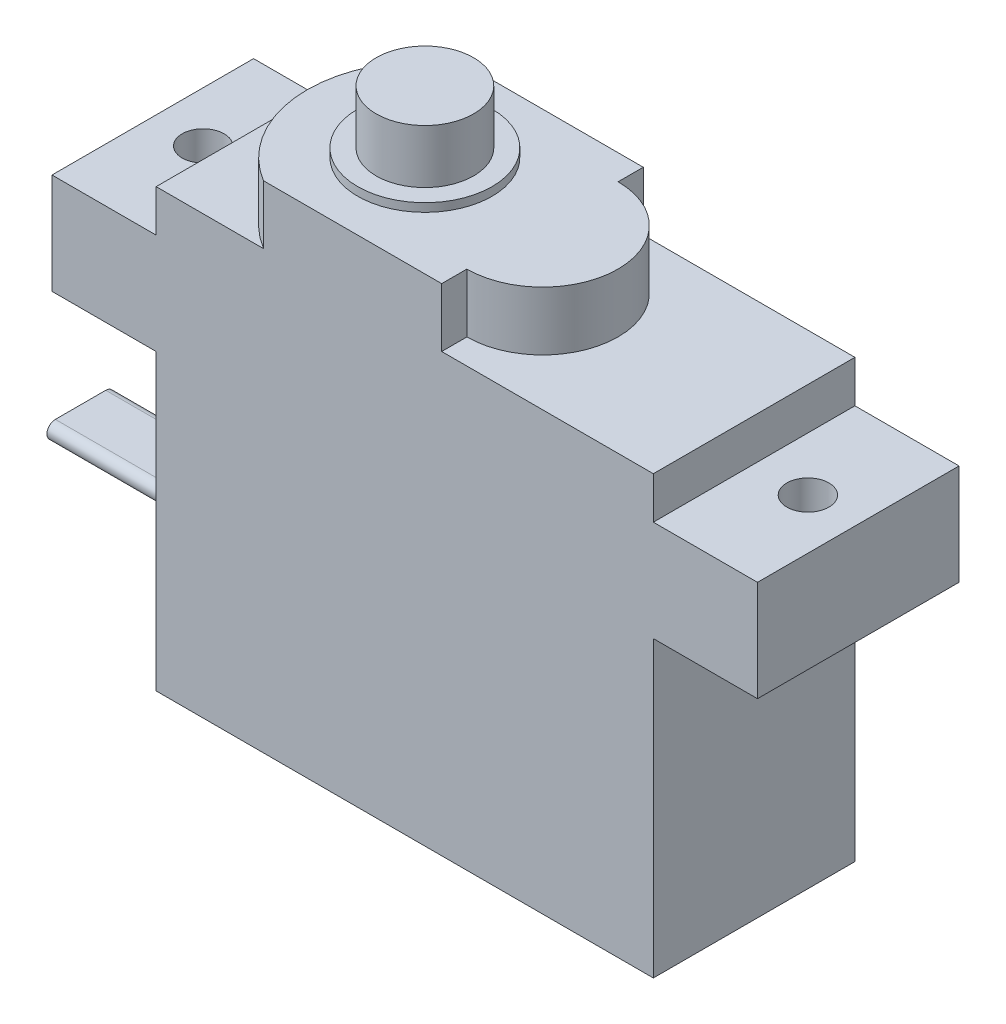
ISO-10303-21;
HEADER;
FILE_DESCRIPTION(('STEP AP214'),'2;1');
FILE_NAME('part.step','',(''),(''),'','','');
FILE_SCHEMA(('AUTOMOTIVE_DESIGN { 1 0 10303 214 1 1 1 1 }'));
ENDSEC;
DATA;
#1=APPLICATION_CONTEXT('core data for automotive mechanical design processes');
#2=APPLICATION_PROTOCOL_DEFINITION('international standard','automotive_design',2000,#1);
#3=PRODUCT_CONTEXT('',#1,'mechanical');
#4=PRODUCT('Part','Part','',(#3));
#5=PRODUCT_RELATED_PRODUCT_CATEGORY('part','',(#4));
#6=PRODUCT_DEFINITION_FORMATION('','',#4);
#7=PRODUCT_DEFINITION_CONTEXT('part definition',#1,'design');
#8=PRODUCT_DEFINITION('design','',#6,#7);
#9=PRODUCT_DEFINITION_SHAPE('','',#8);
#10=(LENGTH_UNIT() NAMED_UNIT(*) SI_UNIT(.MILLI.,.METRE.));
#11=(NAMED_UNIT(*) PLANE_ANGLE_UNIT() SI_UNIT($,.RADIAN.));
#12=(NAMED_UNIT(*) SI_UNIT($,.STERADIAN.) SOLID_ANGLE_UNIT());
#13=UNCERTAINTY_MEASURE_WITH_UNIT(LENGTH_MEASURE(1.E-05),#10,'distance_accuracy_value','');
#14=(GEOMETRIC_REPRESENTATION_CONTEXT(3) GLOBAL_UNCERTAINTY_ASSIGNED_CONTEXT((#13)) GLOBAL_UNIT_ASSIGNED_CONTEXT((#10,
#11,#12)) REPRESENTATION_CONTEXT('',''));
#15=CARTESIAN_POINT('',(0.,0.,0.));
#16=DIRECTION('',(0.,0.,1.));
#17=DIRECTION('',(1.,0.,0.));
#18=AXIS2_PLACEMENT_3D('',#15,#16,#17);
#19=CARTESIAN_POINT('',(-0.5,6.,4.50000000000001));
#20=DIRECTION('',(-1.,0.,0.));
#21=DIRECTION('',(0.,0.,1.));
#22=AXIS2_PLACEMENT_3D('',#19,#20,#21);
#23=PLANE('',#22);
#24=CARTESIAN_POINT('',(-0.5,6.,4.50000000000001));
#25=DIRECTION('',(-1.,0.,0.));
#26=DIRECTION('',(0.,0.,1.));
#27=AXIS2_PLACEMENT_3D('',#24,#25,#26);
#28=CIRCLE('',#27,1.);
#29=CARTESIAN_POINT('',(-0.5,7.,4.50000000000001));
#30=VERTEX_POINT('',#29);
#31=CARTESIAN_POINT('',(-0.5,5.,4.50000000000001));
#32=VERTEX_POINT('',#31);
#33=EDGE_CURVE('E239',#30,#32,#28,.T.);
#34=ORIENTED_EDGE('',*,*,#33,.T.);
#35=DIRECTION('',(0.,0.,1.));
#36=VECTOR('',#35,1.);
#37=CARTESIAN_POINT('',(-0.5,5.,7.50000000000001));
#38=LINE('',#37,#36);
#39=CARTESIAN_POINT('',(-0.5,5.,7.50000000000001));
#40=VERTEX_POINT('',#39);
#41=EDGE_CURVE('E242',#32,#40,#38,.T.);
#42=ORIENTED_EDGE('',*,*,#41,.T.);
#43=CARTESIAN_POINT('',(-0.5,6.,7.5));
#44=DIRECTION('',(-1.,0.,0.));
#45=DIRECTION('',(0.,0.,-1.));
#46=AXIS2_PLACEMENT_3D('',#43,#44,#45);
#47=CIRCLE('',#46,1.);
#48=CARTESIAN_POINT('',(-0.5,7.,7.5));
#49=VERTEX_POINT('',#48);
#50=EDGE_CURVE('E245',#40,#49,#47,.T.);
#51=ORIENTED_EDGE('',*,*,#50,.T.);
#52=DIRECTION('',(0.,0.,-1.));
#53=VECTOR('',#52,1.);
#54=CARTESIAN_POINT('',(-0.5,7.,4.50000000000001));
#55=LINE('',#54,#53);
#56=EDGE_CURVE('E247',#49,#30,#55,.T.);
#57=ORIENTED_EDGE('',*,*,#56,.T.);
#58=EDGE_LOOP('',(#34,#42,#51,#57));
#59=FACE_BOUND('',#58,.T.);
#60=DIRECTION('',(0.,0.,1.));
#61=VECTOR('',#60,1.);
#62=CARTESIAN_POINT('',(-0.5,5.5,4.50000000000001));
#63=LINE('',#62,#61);
#64=CARTESIAN_POINT('',(-0.5,5.5,4.50000000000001));
#65=VERTEX_POINT('',#64);
#66=CARTESIAN_POINT('',(-0.5,5.5,7.50000000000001));
#67=VERTEX_POINT('',#66);
#68=EDGE_CURVE('E846',#65,#67,#63,.T.);
#69=ORIENTED_EDGE('',*,*,#68,.F.);
#70=CARTESIAN_POINT('',(-0.5,6.,4.50000000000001));
#71=DIRECTION('',(-1.,0.,0.));
#72=DIRECTION('',(0.,0.,1.));
#73=AXIS2_PLACEMENT_3D('',#70,#71,#72);
#74=CIRCLE('',#73,0.5);
#75=CARTESIAN_POINT('',(-0.5,6.5,4.50000000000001));
#76=VERTEX_POINT('',#75);
#77=EDGE_CURVE('E230',#76,#65,#74,.T.);
#78=ORIENTED_EDGE('',*,*,#77,.F.);
#79=DIRECTION('',(0.,0.,-1.));
#80=VECTOR('',#79,1.);
#81=CARTESIAN_POINT('',(-0.5,6.5,7.5));
#82=LINE('',#81,#80);
#83=CARTESIAN_POINT('',(-0.5,6.5,7.5));
#84=VERTEX_POINT('',#83);
#85=EDGE_CURVE('E226',#84,#76,#82,.T.);
#86=ORIENTED_EDGE('',*,*,#85,.F.);
#87=CARTESIAN_POINT('',(-0.5,6.,7.5));
#88=DIRECTION('',(-1.,0.,0.));
#89=DIRECTION('',(0.,0.,1.));
#90=AXIS2_PLACEMENT_3D('',#87,#88,#89);
#91=CIRCLE('',#90,0.5);
#92=EDGE_CURVE('E843',#67,#84,#91,.T.);
#93=ORIENTED_EDGE('',*,*,#92,.F.);
#94=EDGE_LOOP('',(#69,#78,#86,#93));
#95=FACE_BOUND('',#94,.T.);
#96=ADVANCED_FACE('F34',(#59,#95),#23,.T.);
#97=CARTESIAN_POINT('',(0.,0.,12.));
#98=DIRECTION('',(1.,0.,0.));
#99=DIRECTION('',(0.,0.,-1.));
#100=AXIS2_PLACEMENT_3D('',#97,#98,#99);
#101=PLANE('',#100);
#102=DIRECTION('',(0.,-1.,0.));
#103=VECTOR('',#102,1.);
#104=CARTESIAN_POINT('',(0.,0.,0.));
#105=LINE('',#104,#103);
#106=CARTESIAN_POINT('',(0.,17.5,0.));
#107=VERTEX_POINT('',#106);
#108=CARTESIAN_POINT('',(0.,0.,0.));
#109=VERTEX_POINT('',#108);
#110=EDGE_CURVE('E420',#107,#109,#105,.T.);
#111=ORIENTED_EDGE('',*,*,#110,.T.);
#112=DIRECTION('',(0.,0.,-1.));
#113=VECTOR('',#112,1.);
#114=CARTESIAN_POINT('',(0.,0.,12.));
#115=LINE('',#114,#113);
#116=CARTESIAN_POINT('',(0.,0.,12.));
#117=VERTEX_POINT('',#116);
#118=EDGE_CURVE('E42',#117,#109,#115,.T.);
#119=ORIENTED_EDGE('',*,*,#118,.F.);
#120=DIRECTION('',(0.,-1.,0.));
#121=VECTOR('',#120,1.);
#122=CARTESIAN_POINT('',(0.,0.,12.));
#123=LINE('',#122,#121);
#124=CARTESIAN_POINT('',(0.,17.5,12.));
#125=VERTEX_POINT('',#124);
#126=EDGE_CURVE('E338',#125,#117,#123,.T.);
#127=ORIENTED_EDGE('',*,*,#126,.F.);
#128=DIRECTION('',(0.,0.,-1.));
#129=VECTOR('',#128,1.);
#130=CARTESIAN_POINT('',(0.,17.5,12.));
#131=LINE('',#130,#129);
#132=EDGE_CURVE('E384',#125,#107,#131,.T.);
#133=ORIENTED_EDGE('',*,*,#132,.T.);
#134=EDGE_LOOP('',(#111,#119,#127,#133));
#135=FACE_BOUND('',#134,.T.);
#136=CARTESIAN_POINT('',(0.,6.,4.50000000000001));
#137=DIRECTION('',(-1.,0.,0.));
#138=DIRECTION('',(0.,0.,1.));
#139=AXIS2_PLACEMENT_3D('',#136,#137,#138);
#140=CIRCLE('',#139,1.);
#141=CARTESIAN_POINT('',(0.,7.,4.50000000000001));
#142=VERTEX_POINT('',#141);
#143=CARTESIAN_POINT('',(0.,5.,4.50000000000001));
#144=VERTEX_POINT('',#143);
#145=EDGE_CURVE('E232',#142,#144,#140,.T.);
#146=ORIENTED_EDGE('',*,*,#145,.F.);
#147=DIRECTION('',(0.,0.,-1.));
#148=VECTOR('',#147,1.);
#149=CARTESIAN_POINT('',(0.,7.,4.50000000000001));
#150=LINE('',#149,#148);
#151=CARTESIAN_POINT('',(0.,7.,7.5));
#152=VERTEX_POINT('',#151);
#153=EDGE_CURVE('E243',#152,#142,#150,.T.);
#154=ORIENTED_EDGE('',*,*,#153,.F.);
#155=CARTESIAN_POINT('',(0.,6.,7.5));
#156=DIRECTION('',(-1.,0.,0.));
#157=DIRECTION('',(0.,0.,-1.));
#158=AXIS2_PLACEMENT_3D('',#155,#156,#157);
#159=CIRCLE('',#158,1.);
#160=CARTESIAN_POINT('',(0.,5.,7.50000000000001));
#161=VERTEX_POINT('',#160);
#162=EDGE_CURVE('E251',#161,#152,#159,.T.);
#163=ORIENTED_EDGE('',*,*,#162,.F.);
#164=DIRECTION('',(0.,0.,1.));
#165=VECTOR('',#164,1.);
#166=CARTESIAN_POINT('',(0.,5.,7.50000000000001));
#167=LINE('',#166,#165);
#168=EDGE_CURVE('E57',#144,#161,#167,.T.);
#169=ORIENTED_EDGE('',*,*,#168,.F.);
#170=EDGE_LOOP('',(#146,#154,#163,#169));
#171=FACE_BOUND('',#170,.T.);
#172=ADVANCED_FACE('F36',(#135,#171),#101,.F.);
#173=CARTESIAN_POINT('',(10.,30.,6.));
#174=DIRECTION('',(0.,1.,0.));
#175=DIRECTION('',(0.,0.,1.));
#176=AXIS2_PLACEMENT_3D('',#173,#174,#175);
#177=PLANE('',#176);
#178=CARTESIAN_POINT('',(10.,30.,6.));
#179=DIRECTION('',(0.,1.,0.));
#180=DIRECTION('',(0.,0.,1.));
#181=AXIS2_PLACEMENT_3D('',#178,#179,#180);
#182=CIRCLE('',#181,4.);
#183=CARTESIAN_POINT('',(10.,30.,10.));
#184=VERTEX_POINT('',#183);
#185=EDGE_CURVE('E270',#184,#184,#182,.T.);
#186=ORIENTED_EDGE('',*,*,#185,.T.);
#187=EDGE_LOOP('',(#186));
#188=FACE_BOUND('',#187,.T.);
#189=CARTESIAN_POINT('',(10.,30.,6.));
#190=DIRECTION('',(0.,1.,0.));
#191=DIRECTION('',(0.,0.,1.));
#192=AXIS2_PLACEMENT_3D('',#189,#190,#191);
#193=CIRCLE('',#192,2.9);
#194=CARTESIAN_POINT('',(10.,30.,8.9));
#195=VERTEX_POINT('',#194);
#196=EDGE_CURVE('E266',#195,#195,#193,.T.);
#197=ORIENTED_EDGE('',*,*,#196,.F.);
#198=EDGE_LOOP('',(#197));
#199=FACE_BOUND('',#198,.T.);
#200=ADVANCED_FACE('F492',(#188,#199),#177,.T.);
#201=CARTESIAN_POINT('',(17.,29.5,5.99999999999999));
#202=DIRECTION('',(0.,-1.,0.));
#203=DIRECTION('',(0.,0.,-1.));
#204=AXIS2_PLACEMENT_3D('',#201,#202,#203);
#205=PLANE('',#204);
#206=DIRECTION('',(0.,0.,-1.));
#207=VECTOR('',#206,1.);
#208=CARTESIAN_POINT('',(17.,29.5,0.));
#209=LINE('',#208,#207);
#210=CARTESIAN_POINT('',(17.,29.5,1.49999999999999));
#211=VERTEX_POINT('',#210);
#212=CARTESIAN_POINT('',(17.,29.5,0.));
#213=VERTEX_POINT('',#212);
#214=EDGE_CURVE('E276',#211,#213,#209,.T.);
#215=ORIENTED_EDGE('',*,*,#214,.T.);
#216=DIRECTION('',(-1.,0.,0.));
#217=VECTOR('',#216,1.);
#218=CARTESIAN_POINT('',(6.39444872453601,29.5,0.));
#219=LINE('',#218,#217);
#220=CARTESIAN_POINT('',(6.39444872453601,29.5,0.));
#221=VERTEX_POINT('',#220);
#222=EDGE_CURVE('E279',#213,#221,#219,.T.);
#223=ORIENTED_EDGE('',*,*,#222,.T.);
#224=CARTESIAN_POINT('',(10.,29.5,6.));
#225=DIRECTION('',(0.,1.,0.));
#226=DIRECTION('',(0.,0.,1.));
#227=AXIS2_PLACEMENT_3D('',#224,#225,#226);
#228=CIRCLE('',#227,7.);
#229=CARTESIAN_POINT('',(6.39444872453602,29.5,12.));
#230=VERTEX_POINT('',#229);
#231=EDGE_CURVE('E282',#221,#230,#228,.T.);
#232=ORIENTED_EDGE('',*,*,#231,.T.);
#233=DIRECTION('',(1.,0.,0.));
#234=VECTOR('',#233,1.);
#235=CARTESIAN_POINT('',(17.,29.5,12.));
#236=LINE('',#235,#234);
#237=CARTESIAN_POINT('',(17.,29.5,12.));
#238=VERTEX_POINT('',#237);
#239=EDGE_CURVE('E284',#230,#238,#236,.T.);
#240=ORIENTED_EDGE('',*,*,#239,.T.);
#241=DIRECTION('',(0.,0.,-1.));
#242=VECTOR('',#241,1.);
#243=CARTESIAN_POINT('',(17.,29.5,10.5));
#244=LINE('',#243,#242);
#245=CARTESIAN_POINT('',(17.,29.5,10.5));
#246=VERTEX_POINT('',#245);
#247=EDGE_CURVE('E286',#238,#246,#244,.T.);
#248=ORIENTED_EDGE('',*,*,#247,.T.);
#249=CARTESIAN_POINT('',(17.,29.5,5.99999999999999));
#250=DIRECTION('',(0.,1.,0.));
#251=DIRECTION('',(0.,0.,-1.));
#252=AXIS2_PLACEMENT_3D('',#249,#250,#251);
#253=CIRCLE('',#252,4.5);
#254=EDGE_CURVE('E288',#246,#211,#253,.T.);
#255=ORIENTED_EDGE('',*,*,#254,.T.);
#256=EDGE_LOOP('',(#215,#223,#232,#240,#248,#255));
#257=FACE_BOUND('',#256,.T.);
#258=CARTESIAN_POINT('',(10.,29.5,6.));
#259=DIRECTION('',(0.,-1.,0.));
#260=DIRECTION('',(0.,0.,-1.));
#261=AXIS2_PLACEMENT_3D('',#258,#259,#260);
#262=CIRCLE('',#261,4.);
#263=CARTESIAN_POINT('',(10.,29.5,2.));
#264=VERTEX_POINT('',#263);
#265=EDGE_CURVE('E11',#264,#264,#262,.F.);
#266=ORIENTED_EDGE('',*,*,#265,.F.);
#267=EDGE_LOOP('',(#266));
#268=FACE_BOUND('',#267,.T.);
#269=ADVANCED_FACE('F462',(#257,#268),#205,.F.);
#270=CARTESIAN_POINT('',(0.,26.,12.));
#271=DIRECTION('',(0.,-1.,0.));
#272=DIRECTION('',(0.,0.,-1.));
#273=AXIS2_PLACEMENT_3D('',#270,#271,#272);
#274=PLANE('',#273);
#275=DIRECTION('',(0.,0.,-1.));
#276=VECTOR('',#275,1.);
#277=CARTESIAN_POINT('',(17.,26.,0.));
#278=LINE('',#277,#276);
#279=CARTESIAN_POINT('',(17.,26.,1.49999999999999));
#280=VERTEX_POINT('',#279);
#281=CARTESIAN_POINT('',(17.,26.,0.));
#282=VERTEX_POINT('',#281);
#283=EDGE_CURVE('E275',#280,#282,#278,.T.);
#284=ORIENTED_EDGE('',*,*,#283,.F.);
#285=CARTESIAN_POINT('',(17.,26.,5.99999999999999));
#286=DIRECTION('',(0.,1.,0.));
#287=DIRECTION('',(0.,0.,-1.));
#288=AXIS2_PLACEMENT_3D('',#285,#286,#287);
#289=CIRCLE('',#288,4.5);
#290=CARTESIAN_POINT('',(17.,26.,10.5));
#291=VERTEX_POINT('',#290);
#292=EDGE_CURVE('E280',#291,#280,#289,.T.);
#293=ORIENTED_EDGE('',*,*,#292,.F.);
#294=DIRECTION('',(0.,0.,-1.));
#295=VECTOR('',#294,1.);
#296=CARTESIAN_POINT('',(17.,26.,10.5));
#297=LINE('',#296,#295);
#298=CARTESIAN_POINT('',(17.,26.,12.));
#299=VERTEX_POINT('',#298);
#300=EDGE_CURVE('E302',#299,#291,#297,.T.);
#301=ORIENTED_EDGE('',*,*,#300,.F.);
#302=DIRECTION('',(-1.,0.,0.));
#303=VECTOR('',#302,1.);
#304=CARTESIAN_POINT('',(0.,26.,12.));
#305=LINE('',#304,#303);
#306=CARTESIAN_POINT('',(29.6,26.,12.));
#307=VERTEX_POINT('',#306);
#308=EDGE_CURVE('E363',#307,#299,#305,.T.);
#309=ORIENTED_EDGE('',*,*,#308,.F.);
#310=DIRECTION('',(0.,0.,-1.));
#311=VECTOR('',#310,1.);
#312=CARTESIAN_POINT('',(29.6,26.,12.));
#313=LINE('',#312,#311);
#314=CARTESIAN_POINT('',(29.6,26.,0.));
#315=VERTEX_POINT('',#314);
#316=EDGE_CURVE('E400',#307,#315,#313,.T.);
#317=ORIENTED_EDGE('',*,*,#316,.T.);
#318=DIRECTION('',(-1.,0.,0.));
#319=VECTOR('',#318,1.);
#320=CARTESIAN_POINT('',(0.,26.,0.));
#321=LINE('',#320,#319);
#322=EDGE_CURVE('E369',#315,#282,#321,.T.);
#323=ORIENTED_EDGE('',*,*,#322,.T.);
#324=EDGE_LOOP('',(#284,#293,#301,#309,#317,#323));
#325=FACE_BOUND('',#324,.T.);
#326=ADVANCED_FACE('F451',(#325),#274,.F.);
#327=CARTESIAN_POINT('',(10.,26.,6.));
#328=DIRECTION('',(0.,1.,0.));
#329=DIRECTION('',(0.,0.,1.));
#330=AXIS2_PLACEMENT_3D('',#327,#328,#329);
#331=CIRCLE('',#330,7.);
#332=CARTESIAN_POINT('',(6.39444872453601,26.,0.));
#333=VERTEX_POINT('',#332);
#334=CARTESIAN_POINT('',(6.39444872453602,26.,12.));
#335=VERTEX_POINT('',#334);
#336=EDGE_CURVE('E299',#333,#335,#331,.T.);
#337=ORIENTED_EDGE('',*,*,#336,.F.);
#338=CARTESIAN_POINT('',(0.,26.,0.));
#339=VERTEX_POINT('',#338);
#340=EDGE_CURVE('E366',#333,#339,#321,.T.);
#341=ORIENTED_EDGE('',*,*,#340,.T.);
#342=DIRECTION('',(0.,0.,-1.));
#343=VECTOR('',#342,1.);
#344=CARTESIAN_POINT('',(0.,26.,12.));
#345=LINE('',#344,#343);
#346=CARTESIAN_POINT('',(0.,26.,12.));
#347=VERTEX_POINT('',#346);
#348=EDGE_CURVE('E397',#347,#339,#345,.T.);
#349=ORIENTED_EDGE('',*,*,#348,.F.);
#350=EDGE_CURVE('E354',#335,#347,#305,.T.);
#351=ORIENTED_EDGE('',*,*,#350,.F.);
#352=EDGE_LOOP('',(#337,#341,#349,#351));
#353=FACE_BOUND('',#352,.T.);
#354=ADVANCED_FACE('F567',(#353),#274,.F.);
#355=CARTESIAN_POINT('',(0.,0.,12.));
#356=DIRECTION('',(0.,1.,0.));
#357=DIRECTION('',(0.,0.,1.));
#358=AXIS2_PLACEMENT_3D('',#355,#356,#357);
#359=PLANE('',#358);
#360=DIRECTION('',(1.,0.,0.));
#361=VECTOR('',#360,1.);
#362=CARTESIAN_POINT('',(0.,0.,0.));
#363=LINE('',#362,#361);
#364=CARTESIAN_POINT('',(29.6,0.,0.));
#365=VERTEX_POINT('',#364);
#366=EDGE_CURVE('E424',#109,#365,#363,.T.);
#367=ORIENTED_EDGE('',*,*,#366,.T.);
#368=DIRECTION('',(0.,0.,-1.));
#369=VECTOR('',#368,1.);
#370=CARTESIAN_POINT('',(29.6,0.,12.));
#371=LINE('',#370,#369);
#372=CARTESIAN_POINT('',(29.6,0.,12.));
#373=VERTEX_POINT('',#372);
#374=EDGE_CURVE('E415',#373,#365,#371,.T.);
#375=ORIENTED_EDGE('',*,*,#374,.F.);
#376=DIRECTION('',(1.,0.,0.));
#377=VECTOR('',#376,1.);
#378=CARTESIAN_POINT('',(0.,0.,12.));
#379=LINE('',#378,#377);
#380=EDGE_CURVE('E341',#117,#373,#379,.T.);
#381=ORIENTED_EDGE('',*,*,#380,.F.);
#382=ORIENTED_EDGE('',*,*,#118,.T.);
#383=EDGE_LOOP('',(#367,#375,#381,#382));
#384=FACE_BOUND('',#383,.T.);
#385=ADVANCED_FACE('F571',(#384),#359,.F.);
#386=CARTESIAN_POINT('',(29.6,0.,12.));
#387=DIRECTION('',(-1.,0.,0.));
#388=DIRECTION('',(0.,0.,1.));
#389=AXIS2_PLACEMENT_3D('',#386,#387,#388);
#390=PLANE('',#389);
#391=DIRECTION('',(0.,1.,0.));
#392=VECTOR('',#391,1.);
#393=CARTESIAN_POINT('',(29.6,0.,0.));
#394=LINE('',#393,#392);
#395=CARTESIAN_POINT('',(29.6,17.5,0.));
#396=VERTEX_POINT('',#395);
#397=EDGE_CURVE('E429',#365,#396,#394,.T.);
#398=ORIENTED_EDGE('',*,*,#397,.T.);
#399=DIRECTION('',(0.,0.,-1.));
#400=VECTOR('',#399,1.);
#401=CARTESIAN_POINT('',(29.6,17.5,12.));
#402=LINE('',#401,#400);
#403=CARTESIAN_POINT('',(29.6,17.5,12.));
#404=VERTEX_POINT('',#403);
#405=EDGE_CURVE('E412',#404,#396,#402,.T.);
#406=ORIENTED_EDGE('',*,*,#405,.F.);
#407=DIRECTION('',(0.,1.,0.));
#408=VECTOR('',#407,1.);
#409=CARTESIAN_POINT('',(29.6,0.,12.));
#410=LINE('',#409,#408);
#411=EDGE_CURVE('E344',#373,#404,#410,.T.);
#412=ORIENTED_EDGE('',*,*,#411,.F.);
#413=ORIENTED_EDGE('',*,*,#374,.T.);
#414=EDGE_LOOP('',(#398,#406,#412,#413));
#415=FACE_BOUND('',#414,.T.);
#416=ADVANCED_FACE('F576',(#415),#390,.F.);
#417=CARTESIAN_POINT('',(29.6,17.5,12.));
#418=DIRECTION('',(0.,1.,0.));
#419=DIRECTION('',(0.,0.,1.));
#420=AXIS2_PLACEMENT_3D('',#417,#418,#419);
#421=PLANE('',#420);
#422=CARTESIAN_POINT('',(32.8,17.5,6.));
#423=DIRECTION('',(0.,1.,0.));
#424=DIRECTION('',(0.,0.,1.));
#425=AXIS2_PLACEMENT_3D('',#422,#423,#424);
#426=CIRCLE('',#425,1.25000000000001);
#427=CARTESIAN_POINT('',(32.8,17.5,7.25));
#428=VERTEX_POINT('',#427);
#429=EDGE_CURVE('E330',#428,#428,#426,.T.);
#430=ORIENTED_EDGE('',*,*,#429,.T.);
#431=EDGE_LOOP('',(#430));
#432=FACE_BOUND('',#431,.T.);
#433=DIRECTION('',(1.,0.,0.));
#434=VECTOR('',#433,1.);
#435=CARTESIAN_POINT('',(29.6,17.5,0.));
#436=LINE('',#435,#434);
#437=CARTESIAN_POINT('',(35.8,17.5,0.));
#438=VERTEX_POINT('',#437);
#439=EDGE_CURVE('E435',#396,#438,#436,.T.);
#440=ORIENTED_EDGE('',*,*,#439,.T.);
#441=DIRECTION('',(0.,0.,-1.));
#442=VECTOR('',#441,1.);
#443=CARTESIAN_POINT('',(35.8,17.5,12.));
#444=LINE('',#443,#442);
#445=CARTESIAN_POINT('',(35.8,17.5,12.));
#446=VERTEX_POINT('',#445);
#447=EDGE_CURVE('E409',#446,#438,#444,.T.);
#448=ORIENTED_EDGE('',*,*,#447,.F.);
#449=DIRECTION('',(1.,0.,0.));
#450=VECTOR('',#449,1.);
#451=CARTESIAN_POINT('',(29.6,17.5,12.));
#452=LINE('',#451,#450);
#453=EDGE_CURVE('E346',#404,#446,#452,.T.);
#454=ORIENTED_EDGE('',*,*,#453,.F.);
#455=ORIENTED_EDGE('',*,*,#405,.T.);
#456=EDGE_LOOP('',(#440,#448,#454,#455));
#457=FACE_BOUND('',#456,.T.);
#458=ADVANCED_FACE('F482',(#432,#457),#421,.F.);
#459=CARTESIAN_POINT('',(35.8,17.5,12.));
#460=DIRECTION('',(-1.,0.,0.));
#461=DIRECTION('',(0.,0.,1.));
#462=AXIS2_PLACEMENT_3D('',#459,#460,#461);
#463=PLANE('',#462);
#464=DIRECTION('',(0.,1.,0.));
#465=VECTOR('',#464,1.);
#466=CARTESIAN_POINT('',(35.8,17.5,0.));
#467=LINE('',#466,#465);
#468=CARTESIAN_POINT('',(35.8,23.5,0.));
#469=VERTEX_POINT('',#468);
#470=EDGE_CURVE('E437',#438,#469,#467,.T.);
#471=ORIENTED_EDGE('',*,*,#470,.T.);
#472=DIRECTION('',(0.,0.,-1.));
#473=VECTOR('',#472,1.);
#474=CARTESIAN_POINT('',(35.8,23.5,12.));
#475=LINE('',#474,#473);
#476=CARTESIAN_POINT('',(35.8,23.5,12.));
#477=VERTEX_POINT('',#476);
#478=EDGE_CURVE('E406',#477,#469,#475,.T.);
#479=ORIENTED_EDGE('',*,*,#478,.F.);
#480=DIRECTION('',(0.,1.,0.));
#481=VECTOR('',#480,1.);
#482=CARTESIAN_POINT('',(35.8,17.5,12.));
#483=LINE('',#482,#481);
#484=EDGE_CURVE('E348',#446,#477,#483,.T.);
#485=ORIENTED_EDGE('',*,*,#484,.F.);
#486=ORIENTED_EDGE('',*,*,#447,.T.);
#487=EDGE_LOOP('',(#471,#479,#485,#486));
#488=FACE_BOUND('',#487,.T.);
#489=ADVANCED_FACE('F473',(#488),#463,.F.);
#490=CARTESIAN_POINT('',(35.8,23.5,12.));
#491=DIRECTION('',(0.,-1.,0.));
#492=DIRECTION('',(1.,0.,0.));
#493=AXIS2_PLACEMENT_3D('',#490,#491,#492);
#494=PLANE('',#493);
#495=CARTESIAN_POINT('',(32.8,23.5,6.));
#496=DIRECTION('',(0.,1.,0.));
#497=DIRECTION('',(0.,0.,1.));
#498=AXIS2_PLACEMENT_3D('',#495,#496,#497);
#499=CIRCLE('',#498,1.25000000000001);
#500=CARTESIAN_POINT('',(32.8,23.5,7.25));
#501=VERTEX_POINT('',#500);
#502=EDGE_CURVE('E327',#501,#501,#499,.T.);
#503=ORIENTED_EDGE('',*,*,#502,.F.);
#504=EDGE_LOOP('',(#503));
#505=FACE_BOUND('',#504,.T.);
#506=DIRECTION('',(-1.,0.,0.));
#507=VECTOR('',#506,1.);
#508=CARTESIAN_POINT('',(35.8,23.5,0.));
#509=LINE('',#508,#507);
#510=CARTESIAN_POINT('',(29.6,23.5,0.));
#511=VERTEX_POINT('',#510);
#512=EDGE_CURVE('E438',#469,#511,#509,.T.);
#513=ORIENTED_EDGE('',*,*,#512,.T.);
#514=DIRECTION('',(0.,0.,-1.));
#515=VECTOR('',#514,1.);
#516=CARTESIAN_POINT('',(29.6,23.5,12.));
#517=LINE('',#516,#515);
#518=CARTESIAN_POINT('',(29.6,23.5,12.));
#519=VERTEX_POINT('',#518);
#520=EDGE_CURVE('E403',#519,#511,#517,.T.);
#521=ORIENTED_EDGE('',*,*,#520,.F.);
#522=DIRECTION('',(-1.,0.,0.));
#523=VECTOR('',#522,1.);
#524=CARTESIAN_POINT('',(35.8,23.5,12.));
#525=LINE('',#524,#523);
#526=EDGE_CURVE('E350',#477,#519,#525,.T.);
#527=ORIENTED_EDGE('',*,*,#526,.F.);
#528=ORIENTED_EDGE('',*,*,#478,.T.);
#529=EDGE_LOOP('',(#513,#521,#527,#528));
#530=FACE_BOUND('',#529,.T.);
#531=ADVANCED_FACE('F471',(#505,#530),#494,.F.);
#532=CARTESIAN_POINT('',(29.6,23.5,12.));
#533=DIRECTION('',(-1.,0.,0.));
#534=DIRECTION('',(0.,0.,1.));
#535=AXIS2_PLACEMENT_3D('',#532,#533,#534);
#536=PLANE('',#535);
#537=DIRECTION('',(0.,1.,0.));
#538=VECTOR('',#537,1.);
#539=CARTESIAN_POINT('',(29.6,23.5,0.));
#540=LINE('',#539,#538);
#541=EDGE_CURVE('E370',#511,#315,#540,.T.);
#542=ORIENTED_EDGE('',*,*,#541,.T.);
#543=ORIENTED_EDGE('',*,*,#316,.F.);
#544=DIRECTION('',(0.,1.,0.));
#545=VECTOR('',#544,1.);
#546=CARTESIAN_POINT('',(29.6,23.5,12.));
#547=LINE('',#546,#545);
#548=EDGE_CURVE('E352',#519,#307,#547,.T.);
#549=ORIENTED_EDGE('',*,*,#548,.F.);
#550=ORIENTED_EDGE('',*,*,#520,.T.);
#551=EDGE_LOOP('',(#542,#543,#549,#550));
#552=FACE_BOUND('',#551,.T.);
#553=ADVANCED_FACE('F445',(#552),#536,.F.);
#554=CARTESIAN_POINT('',(0.,23.5,12.));
#555=DIRECTION('',(1.,0.,0.));
#556=DIRECTION('',(0.,0.,-1.));
#557=AXIS2_PLACEMENT_3D('',#554,#555,#556);
#558=PLANE('',#557);
#559=DIRECTION('',(0.,-1.,0.));
#560=VECTOR('',#559,1.);
#561=CARTESIAN_POINT('',(0.,23.5,0.));
#562=LINE('',#561,#560);
#563=CARTESIAN_POINT('',(0.,23.5,0.));
#564=VERTEX_POINT('',#563);
#565=EDGE_CURVE('E376',#339,#564,#562,.T.);
#566=ORIENTED_EDGE('',*,*,#565,.T.);
#567=DIRECTION('',(0.,0.,-1.));
#568=VECTOR('',#567,1.);
#569=CARTESIAN_POINT('',(0.,23.5,12.));
#570=LINE('',#569,#568);
#571=CARTESIAN_POINT('',(0.,23.5,12.));
#572=VERTEX_POINT('',#571);
#573=EDGE_CURVE('E394',#572,#564,#570,.T.);
#574=ORIENTED_EDGE('',*,*,#573,.F.);
#575=DIRECTION('',(0.,-1.,0.));
#576=VECTOR('',#575,1.);
#577=CARTESIAN_POINT('',(0.,23.5,12.));
#578=LINE('',#577,#576);
#579=EDGE_CURVE('E357',#347,#572,#578,.T.);
#580=ORIENTED_EDGE('',*,*,#579,.F.);
#581=ORIENTED_EDGE('',*,*,#348,.T.);
#582=EDGE_LOOP('',(#566,#574,#580,#581));
#583=FACE_BOUND('',#582,.T.);
#584=ADVANCED_FACE('F480',(#583),#558,.F.);
#585=CARTESIAN_POINT('',(0.,23.5,12.));
#586=DIRECTION('',(0.,-1.,0.));
#587=DIRECTION('',(0.,0.,-1.));
#588=AXIS2_PLACEMENT_3D('',#585,#586,#587);
#589=PLANE('',#588);
#590=CARTESIAN_POINT('',(-3.20000000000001,23.5,6.));
#591=DIRECTION('',(0.,1.,0.));
#592=DIRECTION('',(0.,0.,1.));
#593=AXIS2_PLACEMENT_3D('',#590,#591,#592);
#594=CIRCLE('',#593,1.25);
#595=CARTESIAN_POINT('',(-3.20000000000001,23.5,7.25));
#596=VERTEX_POINT('',#595);
#597=EDGE_CURVE('E334',#596,#596,#594,.T.);
#598=ORIENTED_EDGE('',*,*,#597,.F.);
#599=EDGE_LOOP('',(#598));
#600=FACE_BOUND('',#599,.T.);
#601=DIRECTION('',(-1.,0.,0.));
#602=VECTOR('',#601,1.);
#603=CARTESIAN_POINT('',(0.,23.5,0.));
#604=LINE('',#603,#602);
#605=CARTESIAN_POINT('',(-6.2,23.5,0.));
#606=VERTEX_POINT('',#605);
#607=EDGE_CURVE('E379',#564,#606,#604,.T.);
#608=ORIENTED_EDGE('',*,*,#607,.T.);
#609=DIRECTION('',(0.,0.,-1.));
#610=VECTOR('',#609,1.);
#611=CARTESIAN_POINT('',(-6.2,23.5,12.));
#612=LINE('',#611,#610);
#613=CARTESIAN_POINT('',(-6.2,23.5,12.));
#614=VERTEX_POINT('',#613);
#615=EDGE_CURVE('E391',#614,#606,#612,.T.);
#616=ORIENTED_EDGE('',*,*,#615,.F.);
#617=DIRECTION('',(-1.,0.,0.));
#618=VECTOR('',#617,1.);
#619=CARTESIAN_POINT('',(0.,23.5,12.));
#620=LINE('',#619,#618);
#621=EDGE_CURVE('E594',#572,#614,#620,.T.);
#622=ORIENTED_EDGE('',*,*,#621,.F.);
#623=ORIENTED_EDGE('',*,*,#573,.T.);
#624=EDGE_LOOP('',(#608,#616,#622,#623));
#625=FACE_BOUND('',#624,.T.);
#626=ADVANCED_FACE('F558',(#600,#625),#589,.F.);
#627=CARTESIAN_POINT('',(-6.2,17.5,12.));
#628=DIRECTION('',(1.,0.,0.));
#629=DIRECTION('',(0.,1.,0.));
#630=AXIS2_PLACEMENT_3D('',#627,#628,#629);
#631=PLANE('',#630);
#632=DIRECTION('',(0.,-1.,0.));
#633=VECTOR('',#632,1.);
#634=CARTESIAN_POINT('',(-6.2,17.5,0.));
#635=LINE('',#634,#633);
#636=CARTESIAN_POINT('',(-6.2,17.5,0.));
#637=VERTEX_POINT('',#636);
#638=EDGE_CURVE('E381',#606,#637,#635,.T.);
#639=ORIENTED_EDGE('',*,*,#638,.T.);
#640=DIRECTION('',(0.,0.,-1.));
#641=VECTOR('',#640,1.);
#642=CARTESIAN_POINT('',(-6.2,17.5,12.));
#643=LINE('',#642,#641);
#644=CARTESIAN_POINT('',(-6.2,17.5,12.));
#645=VERTEX_POINT('',#644);
#646=EDGE_CURVE('E387',#645,#637,#643,.T.);
#647=ORIENTED_EDGE('',*,*,#646,.F.);
#648=DIRECTION('',(0.,-1.,0.));
#649=VECTOR('',#648,1.);
#650=CARTESIAN_POINT('',(-6.2,17.5,12.));
#651=LINE('',#650,#649);
#652=EDGE_CURVE('E595',#614,#645,#651,.T.);
#653=ORIENTED_EDGE('',*,*,#652,.F.);
#654=ORIENTED_EDGE('',*,*,#615,.T.);
#655=EDGE_LOOP('',(#639,#647,#653,#654));
#656=FACE_BOUND('',#655,.T.);
#657=ADVANCED_FACE('F555',(#656),#631,.F.);
#658=CARTESIAN_POINT('',(-6.2,17.5,12.));
#659=DIRECTION('',(0.,1.,0.));
#660=DIRECTION('',(0.,0.,1.));
#661=AXIS2_PLACEMENT_3D('',#658,#659,#660);
#662=PLANE('',#661);
#663=CARTESIAN_POINT('',(-3.20000000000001,17.5,6.));
#664=DIRECTION('',(0.,1.,0.));
#665=DIRECTION('',(0.,0.,1.));
#666=AXIS2_PLACEMENT_3D('',#663,#664,#665);
#667=CIRCLE('',#666,1.25);
#668=CARTESIAN_POINT('',(-3.20000000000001,17.5,7.25));
#669=VERTEX_POINT('',#668);
#670=EDGE_CURVE('E337',#669,#669,#667,.T.);
#671=ORIENTED_EDGE('',*,*,#670,.T.);
#672=EDGE_LOOP('',(#671));
#673=FACE_BOUND('',#672,.T.);
#674=DIRECTION('',(1.,0.,0.));
#675=VECTOR('',#674,1.);
#676=CARTESIAN_POINT('',(-6.2,17.5,0.));
#677=LINE('',#676,#675);
#678=EDGE_CURVE('E342',#637,#107,#677,.T.);
#679=ORIENTED_EDGE('',*,*,#678,.T.);
#680=ORIENTED_EDGE('',*,*,#132,.F.);
#681=DIRECTION('',(1.,0.,0.));
#682=VECTOR('',#681,1.);
#683=CARTESIAN_POINT('',(-6.2,17.5,12.));
#684=LINE('',#683,#682);
#685=EDGE_CURVE('E388',#645,#125,#684,.T.);
#686=ORIENTED_EDGE('',*,*,#685,.F.);
#687=ORIENTED_EDGE('',*,*,#646,.T.);
#688=EDGE_LOOP('',(#679,#680,#686,#687));
#689=FACE_BOUND('',#688,.T.);
#690=ADVANCED_FACE('F550',(#673,#689),#662,.F.);
#691=CARTESIAN_POINT('',(0.,17.5,12.));
#692=DIRECTION('',(0.,0.,-1.));
#693=DIRECTION('',(-1.,0.,0.));
#694=AXIS2_PLACEMENT_3D('',#691,#692,#693);
#695=PLANE('',#694);
#696=ORIENTED_EDGE('',*,*,#126,.T.);
#697=ORIENTED_EDGE('',*,*,#380,.T.);
#698=ORIENTED_EDGE('',*,*,#411,.T.);
#699=ORIENTED_EDGE('',*,*,#453,.T.);
#700=ORIENTED_EDGE('',*,*,#484,.T.);
#701=ORIENTED_EDGE('',*,*,#526,.T.);
#702=ORIENTED_EDGE('',*,*,#548,.T.);
#703=ORIENTED_EDGE('',*,*,#308,.T.);
#704=DIRECTION('',(0.,-1.,0.));
#705=VECTOR('',#704,1.);
#706=CARTESIAN_POINT('',(17.,29.5,12.));
#707=LINE('',#706,#705);
#708=EDGE_CURVE('E307',#238,#299,#707,.T.);
#709=ORIENTED_EDGE('',*,*,#708,.F.);
#710=ORIENTED_EDGE('',*,*,#239,.F.);
#711=DIRECTION('',(0.,-1.,0.));
#712=VECTOR('',#711,1.);
#713=CARTESIAN_POINT('',(6.39444872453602,29.5,12.));
#714=LINE('',#713,#712);
#715=EDGE_CURVE('E309',#230,#335,#714,.T.);
#716=ORIENTED_EDGE('',*,*,#715,.T.);
#717=ORIENTED_EDGE('',*,*,#350,.T.);
#718=ORIENTED_EDGE('',*,*,#579,.T.);
#719=ORIENTED_EDGE('',*,*,#621,.T.);
#720=ORIENTED_EDGE('',*,*,#652,.T.);
#721=ORIENTED_EDGE('',*,*,#685,.T.);
#722=EDGE_LOOP('',(#696,#697,#698,#699,#700,#701,#702,#703,#709,#710,#716,#717,#718,#719,#720,#721));
#723=FACE_BOUND('',#722,.T.);
#724=ADVANCED_FACE('F467',(#723),#695,.F.);
#725=CARTESIAN_POINT('',(0.,17.5,0.));
#726=DIRECTION('',(0.,0.,-1.));
#727=DIRECTION('',(-1.,0.,0.));
#728=AXIS2_PLACEMENT_3D('',#725,#726,#727);
#729=PLANE('',#728);
#730=ORIENTED_EDGE('',*,*,#110,.F.);
#731=ORIENTED_EDGE('',*,*,#678,.F.);
#732=ORIENTED_EDGE('',*,*,#638,.F.);
#733=ORIENTED_EDGE('',*,*,#607,.F.);
#734=ORIENTED_EDGE('',*,*,#565,.F.);
#735=ORIENTED_EDGE('',*,*,#340,.F.);
#736=DIRECTION('',(0.,-1.,0.));
#737=VECTOR('',#736,1.);
#738=CARTESIAN_POINT('',(6.39444872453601,29.5,0.));
#739=LINE('',#738,#737);
#740=EDGE_CURVE('E316',#221,#333,#739,.T.);
#741=ORIENTED_EDGE('',*,*,#740,.F.);
#742=ORIENTED_EDGE('',*,*,#222,.F.);
#743=DIRECTION('',(0.,-1.,0.));
#744=VECTOR('',#743,1.);
#745=CARTESIAN_POINT('',(17.,29.5,0.));
#746=LINE('',#745,#744);
#747=EDGE_CURVE('E331',#213,#282,#746,.T.);
#748=ORIENTED_EDGE('',*,*,#747,.T.);
#749=ORIENTED_EDGE('',*,*,#322,.F.);
#750=ORIENTED_EDGE('',*,*,#541,.F.);
#751=ORIENTED_EDGE('',*,*,#512,.F.);
#752=ORIENTED_EDGE('',*,*,#470,.F.);
#753=ORIENTED_EDGE('',*,*,#439,.F.);
#754=ORIENTED_EDGE('',*,*,#397,.F.);
#755=ORIENTED_EDGE('',*,*,#366,.F.);
#756=EDGE_LOOP('',(#730,#731,#732,#733,#734,#735,#741,#742,#748,#749,#750,#751,#752,#753,#754,#755));
#757=FACE_BOUND('',#756,.T.);
#758=ADVANCED_FACE('F453',(#757),#729,.T.);
#759=CARTESIAN_POINT('',(-3.20000000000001,0.,6.));
#760=DIRECTION('',(0.,1.,0.));
#761=DIRECTION('',(0.,0.,1.));
#762=AXIS2_PLACEMENT_3D('',#759,#760,#761);
#763=CYLINDRICAL_SURFACE('',#762,1.25);
#764=ORIENTED_EDGE('',*,*,#597,.T.);
#765=EDGE_LOOP('',(#764));
#766=FACE_BOUND('',#765,.T.);
#767=ORIENTED_EDGE('',*,*,#670,.F.);
#768=EDGE_LOOP('',(#767));
#769=FACE_BOUND('',#768,.T.);
#770=ADVANCED_FACE('F543',(#766,#769),#763,.F.);
#771=CARTESIAN_POINT('',(32.8,0.,6.));
#772=DIRECTION('',(0.,1.,0.));
#773=DIRECTION('',(0.,0.,1.));
#774=AXIS2_PLACEMENT_3D('',#771,#772,#773);
#775=CYLINDRICAL_SURFACE('',#774,1.25000000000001);
#776=ORIENTED_EDGE('',*,*,#502,.T.);
#777=EDGE_LOOP('',(#776));
#778=FACE_BOUND('',#777,.T.);
#779=ORIENTED_EDGE('',*,*,#429,.F.);
#780=EDGE_LOOP('',(#779));
#781=FACE_BOUND('',#780,.T.);
#782=ADVANCED_FACE('F540',(#778,#781),#775,.F.);
#783=CARTESIAN_POINT('',(17.,29.5,0.));
#784=DIRECTION('',(-1.,0.,0.));
#785=DIRECTION('',(0.,0.,1.));
#786=AXIS2_PLACEMENT_3D('',#783,#784,#785);
#787=PLANE('',#786);
#788=ORIENTED_EDGE('',*,*,#283,.T.);
#789=ORIENTED_EDGE('',*,*,#747,.F.);
#790=ORIENTED_EDGE('',*,*,#214,.F.);
#791=DIRECTION('',(0.,-1.,0.));
#792=VECTOR('',#791,1.);
#793=CARTESIAN_POINT('',(17.,29.5,1.49999999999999));
#794=LINE('',#793,#792);
#795=EDGE_CURVE('E290',#211,#280,#794,.T.);
#796=ORIENTED_EDGE('',*,*,#795,.T.);
#797=EDGE_LOOP('',(#788,#789,#790,#796));
#798=FACE_BOUND('',#797,.T.);
#799=ADVANCED_FACE('F458',(#798),#787,.F.);
#800=CARTESIAN_POINT('',(10.,29.5,6.));
#801=DIRECTION('',(0.,-1.,0.));
#802=DIRECTION('',(0.,0.,-1.));
#803=AXIS2_PLACEMENT_3D('',#800,#801,#802);
#804=CYLINDRICAL_SURFACE('',#803,7.);
#805=ORIENTED_EDGE('',*,*,#336,.T.);
#806=ORIENTED_EDGE('',*,*,#715,.F.);
#807=ORIENTED_EDGE('',*,*,#231,.F.);
#808=ORIENTED_EDGE('',*,*,#740,.T.);
#809=EDGE_LOOP('',(#805,#806,#807,#808));
#810=FACE_BOUND('',#809,.T.);
#811=ADVANCED_FACE('F534',(#810),#804,.T.);
#812=CARTESIAN_POINT('',(17.,29.5,10.5));
#813=DIRECTION('',(-1.,0.,0.));
#814=DIRECTION('',(0.,0.,1.));
#815=AXIS2_PLACEMENT_3D('',#812,#813,#814);
#816=PLANE('',#815);
#817=ORIENTED_EDGE('',*,*,#300,.T.);
#818=DIRECTION('',(0.,-1.,0.));
#819=VECTOR('',#818,1.);
#820=CARTESIAN_POINT('',(17.,29.5,10.5));
#821=LINE('',#820,#819);
#822=EDGE_CURVE('E310',#246,#291,#821,.T.);
#823=ORIENTED_EDGE('',*,*,#822,.F.);
#824=ORIENTED_EDGE('',*,*,#247,.F.);
#825=ORIENTED_EDGE('',*,*,#708,.T.);
#826=EDGE_LOOP('',(#817,#823,#824,#825));
#827=FACE_BOUND('',#826,.T.);
#828=ADVANCED_FACE('F465',(#827),#816,.F.);
#829=CARTESIAN_POINT('',(17.,29.5,5.99999999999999));
#830=DIRECTION('',(0.,-1.,0.));
#831=DIRECTION('',(0.,0.,-1.));
#832=AXIS2_PLACEMENT_3D('',#829,#830,#831);
#833=CYLINDRICAL_SURFACE('',#832,4.5);
#834=ORIENTED_EDGE('',*,*,#292,.T.);
#835=ORIENTED_EDGE('',*,*,#795,.F.);
#836=ORIENTED_EDGE('',*,*,#254,.F.);
#837=ORIENTED_EDGE('',*,*,#822,.T.);
#838=EDGE_LOOP('',(#834,#835,#836,#837));
#839=FACE_BOUND('',#838,.T.);
#840=ADVANCED_FACE('F460',(#839),#833,.T.);
#841=CARTESIAN_POINT('',(10.,30.,6.));
#842=DIRECTION('',(0.,-1.,0.));
#843=DIRECTION('',(0.,0.,-1.));
#844=AXIS2_PLACEMENT_3D('',#841,#842,#843);
#845=CYLINDRICAL_SURFACE('',#844,4.);
#846=ORIENTED_EDGE('',*,*,#185,.F.);
#847=EDGE_LOOP('',(#846));
#848=FACE_BOUND('',#847,.T.);
#849=ORIENTED_EDGE('',*,*,#265,.T.);
#850=EDGE_LOOP('',(#849));
#851=FACE_BOUND('',#850,.T.);
#852=ADVANCED_FACE('F520',(#848,#851),#845,.T.);
#853=CARTESIAN_POINT('',(10.,33.2,6.));
#854=DIRECTION('',(0.,-1.,0.));
#855=DIRECTION('',(0.,0.,-1.));
#856=AXIS2_PLACEMENT_3D('',#853,#854,#855);
#857=CYLINDRICAL_SURFACE('',#856,2.9);
#858=CARTESIAN_POINT('',(10.,33.2,6.));
#859=DIRECTION('',(0.,1.,0.));
#860=DIRECTION('',(0.,0.,1.));
#861=AXIS2_PLACEMENT_3D('',#858,#859,#860);
#862=CIRCLE('',#861,2.9);
#863=CARTESIAN_POINT('',(10.,33.2,8.9));
#864=VERTEX_POINT('',#863);
#865=EDGE_CURVE('E267',#864,#864,#862,.T.);
#866=ORIENTED_EDGE('',*,*,#865,.F.);
#867=EDGE_LOOP('',(#866));
#868=FACE_BOUND('',#867,.T.);
#869=ORIENTED_EDGE('',*,*,#196,.T.);
#870=EDGE_LOOP('',(#869));
#871=FACE_BOUND('',#870,.T.);
#872=ADVANCED_FACE('F516',(#868,#871),#857,.T.);
#873=CARTESIAN_POINT('',(10.,33.2,6.));
#874=DIRECTION('',(0.,1.,0.));
#875=DIRECTION('',(0.,0.,1.));
#876=AXIS2_PLACEMENT_3D('',#873,#874,#875);
#877=PLANE('',#876);
#878=ORIENTED_EDGE('',*,*,#865,.T.);
#879=EDGE_LOOP('',(#878));
#880=FACE_BOUND('',#879,.T.);
#881=ADVANCED_FACE('F512',(#880),#877,.T.);
#882=CARTESIAN_POINT('',(-0.5,6.,4.50000000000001));
#883=DIRECTION('',(1.,0.,0.));
#884=DIRECTION('',(0.,0.,-1.));
#885=AXIS2_PLACEMENT_3D('',#882,#883,#884);
#886=CYLINDRICAL_SURFACE('',#885,1.);
#887=ORIENTED_EDGE('',*,*,#145,.T.);
#888=DIRECTION('',(1.,0.,0.));
#889=VECTOR('',#888,1.);
#890=CARTESIAN_POINT('',(-0.5,5.,4.50000000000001));
#891=LINE('',#890,#889);
#892=EDGE_CURVE('E264',#32,#144,#891,.T.);
#893=ORIENTED_EDGE('',*,*,#892,.F.);
#894=ORIENTED_EDGE('',*,*,#33,.F.);
#895=DIRECTION('',(1.,0.,0.));
#896=VECTOR('',#895,1.);
#897=CARTESIAN_POINT('',(-0.5,7.,4.50000000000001));
#898=LINE('',#897,#896);
#899=EDGE_CURVE('E248',#30,#142,#898,.T.);
#900=ORIENTED_EDGE('',*,*,#899,.T.);
#901=EDGE_LOOP('',(#887,#893,#894,#900));
#902=FACE_BOUND('',#901,.T.);
#903=ADVANCED_FACE('F508',(#902),#886,.T.);
#904=CARTESIAN_POINT('',(-0.5,5.,7.50000000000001));
#905=DIRECTION('',(0.,1.,0.));
#906=DIRECTION('',(0.,0.,1.));
#907=AXIS2_PLACEMENT_3D('',#904,#905,#906);
#908=PLANE('',#907);
#909=ORIENTED_EDGE('',*,*,#168,.T.);
#910=DIRECTION('',(1.,0.,0.));
#911=VECTOR('',#910,1.);
#912=CARTESIAN_POINT('',(-0.5,5.,7.50000000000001));
#913=LINE('',#912,#911);
#914=EDGE_CURVE('E261',#40,#161,#913,.T.);
#915=ORIENTED_EDGE('',*,*,#914,.F.);
#916=ORIENTED_EDGE('',*,*,#41,.F.);
#917=ORIENTED_EDGE('',*,*,#892,.T.);
#918=EDGE_LOOP('',(#909,#915,#916,#917));
#919=FACE_BOUND('',#918,.T.);
#920=ADVANCED_FACE('F504',(#919),#908,.F.);
#921=CARTESIAN_POINT('',(-0.5,6.,7.5));
#922=DIRECTION('',(1.,0.,0.));
#923=DIRECTION('',(0.,0.,-1.));
#924=AXIS2_PLACEMENT_3D('',#921,#922,#923);
#925=CYLINDRICAL_SURFACE('',#924,1.);
#926=ORIENTED_EDGE('',*,*,#162,.T.);
#927=DIRECTION('',(1.,0.,0.));
#928=VECTOR('',#927,1.);
#929=CARTESIAN_POINT('',(-0.5,7.,7.5));
#930=LINE('',#929,#928);
#931=EDGE_CURVE('E258',#49,#152,#930,.T.);
#932=ORIENTED_EDGE('',*,*,#931,.F.);
#933=ORIENTED_EDGE('',*,*,#50,.F.);
#934=ORIENTED_EDGE('',*,*,#914,.T.);
#935=EDGE_LOOP('',(#926,#932,#933,#934));
#936=FACE_BOUND('',#935,.T.);
#937=ADVANCED_FACE('F500',(#936),#925,.T.);
#938=CARTESIAN_POINT('',(-0.5,7.,4.50000000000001));
#939=DIRECTION('',(0.,-1.,0.));
#940=DIRECTION('',(0.,0.,-1.));
#941=AXIS2_PLACEMENT_3D('',#938,#939,#940);
#942=PLANE('',#941);
#943=ORIENTED_EDGE('',*,*,#153,.T.);
#944=ORIENTED_EDGE('',*,*,#899,.F.);
#945=ORIENTED_EDGE('',*,*,#56,.F.);
#946=ORIENTED_EDGE('',*,*,#931,.T.);
#947=EDGE_LOOP('',(#943,#944,#945,#946));
#948=FACE_BOUND('',#947,.T.);
#949=ADVANCED_FACE('F497',(#948),#942,.F.);
#950=CARTESIAN_POINT('',(-10.5,6.,4.50000000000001));
#951=DIRECTION('',(1.,0.,0.));
#952=DIRECTION('',(0.,0.,-1.));
#953=AXIS2_PLACEMENT_3D('',#950,#951,#952);
#954=CYLINDRICAL_SURFACE('',#953,0.5);
#955=ORIENTED_EDGE('',*,*,#77,.T.);
#956=DIRECTION('',(1.,0.,0.));
#957=VECTOR('',#956,1.);
#958=CARTESIAN_POINT('',(-10.5,5.5,4.50000000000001));
#959=LINE('',#958,#957);
#960=CARTESIAN_POINT('',(-10.5,5.5,4.50000000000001));
#961=VERTEX_POINT('',#960);
#962=EDGE_CURVE('E211',#961,#65,#959,.T.);
#963=ORIENTED_EDGE('',*,*,#962,.F.);
#964=CARTESIAN_POINT('',(-10.5,6.,4.50000000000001));
#965=DIRECTION('',(-1.,0.,0.));
#966=DIRECTION('',(0.,0.,1.));
#967=AXIS2_PLACEMENT_3D('',#964,#965,#966);
#968=CIRCLE('',#967,0.5);
#969=CARTESIAN_POINT('',(-10.5,6.5,4.50000000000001));
#970=VERTEX_POINT('',#969);
#971=EDGE_CURVE('E218',#970,#961,#968,.T.);
#972=ORIENTED_EDGE('',*,*,#971,.F.);
#973=DIRECTION('',(1.,0.,0.));
#974=VECTOR('',#973,1.);
#975=CARTESIAN_POINT('',(-10.5,6.5,4.50000000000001));
#976=LINE('',#975,#974);
#977=EDGE_CURVE('E841',#970,#76,#976,.T.);
#978=ORIENTED_EDGE('',*,*,#977,.T.);
#979=EDGE_LOOP('',(#955,#963,#972,#978));
#980=FACE_BOUND('',#979,.T.);
#981=ADVANCED_FACE('F228',(#980),#954,.T.);
#982=CARTESIAN_POINT('',(-10.5,5.5,4.50000000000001));
#983=DIRECTION('',(0.,1.,0.));
#984=DIRECTION('',(0.,0.,1.));
#985=AXIS2_PLACEMENT_3D('',#982,#983,#984);
#986=PLANE('',#985);
#987=ORIENTED_EDGE('',*,*,#68,.T.);
#988=DIRECTION('',(1.,0.,0.));
#989=VECTOR('',#988,1.);
#990=CARTESIAN_POINT('',(-10.5,5.5,7.50000000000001));
#991=LINE('',#990,#989);
#992=CARTESIAN_POINT('',(-10.5,5.5,7.50000000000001));
#993=VERTEX_POINT('',#992);
#994=EDGE_CURVE('E214',#993,#67,#991,.T.);
#995=ORIENTED_EDGE('',*,*,#994,.F.);
#996=DIRECTION('',(0.,0.,1.));
#997=VECTOR('',#996,1.);
#998=CARTESIAN_POINT('',(-10.5,5.5,4.50000000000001));
#999=LINE('',#998,#997);
#1000=EDGE_CURVE('E207',#961,#993,#999,.T.);
#1001=ORIENTED_EDGE('',*,*,#1000,.F.);
#1002=ORIENTED_EDGE('',*,*,#962,.T.);
#1003=EDGE_LOOP('',(#987,#995,#1001,#1002));
#1004=FACE_BOUND('',#1003,.T.);
#1005=ADVANCED_FACE('F209',(#1004),#986,.F.);
#1006=CARTESIAN_POINT('',(-10.5,6.,7.5));
#1007=DIRECTION('',(1.,0.,0.));
#1008=DIRECTION('',(0.,0.,-1.));
#1009=AXIS2_PLACEMENT_3D('',#1006,#1007,#1008);
#1010=CYLINDRICAL_SURFACE('',#1009,0.5);
#1011=ORIENTED_EDGE('',*,*,#92,.T.);
#1012=DIRECTION('',(1.,0.,0.));
#1013=VECTOR('',#1012,1.);
#1014=CARTESIAN_POINT('',(-10.5,6.5,7.5));
#1015=LINE('',#1014,#1013);
#1016=CARTESIAN_POINT('',(-10.5,6.5,7.5));
#1017=VERTEX_POINT('',#1016);
#1018=EDGE_CURVE('E49',#1017,#84,#1015,.T.);
#1019=ORIENTED_EDGE('',*,*,#1018,.F.);
#1020=CARTESIAN_POINT('',(-10.5,6.,7.5));
#1021=DIRECTION('',(-1.,0.,0.));
#1022=DIRECTION('',(0.,0.,1.));
#1023=AXIS2_PLACEMENT_3D('',#1020,#1021,#1022);
#1024=CIRCLE('',#1023,0.5);
#1025=EDGE_CURVE('E217',#993,#1017,#1024,.T.);
#1026=ORIENTED_EDGE('',*,*,#1025,.F.);
#1027=ORIENTED_EDGE('',*,*,#994,.T.);
#1028=EDGE_LOOP('',(#1011,#1019,#1026,#1027));
#1029=FACE_BOUND('',#1028,.T.);
#1030=ADVANCED_FACE('F811',(#1029),#1010,.T.);
#1031=CARTESIAN_POINT('',(-10.5,6.5,7.5));
#1032=DIRECTION('',(0.,-1.,0.));
#1033=DIRECTION('',(0.,0.,-1.));
#1034=AXIS2_PLACEMENT_3D('',#1031,#1032,#1033);
#1035=PLANE('',#1034);
#1036=ORIENTED_EDGE('',*,*,#85,.T.);
#1037=ORIENTED_EDGE('',*,*,#977,.F.);
#1038=DIRECTION('',(0.,0.,-1.));
#1039=VECTOR('',#1038,1.);
#1040=CARTESIAN_POINT('',(-10.5,6.5,7.5));
#1041=LINE('',#1040,#1039);
#1042=EDGE_CURVE('E222',#1017,#970,#1041,.T.);
#1043=ORIENTED_EDGE('',*,*,#1042,.F.);
#1044=ORIENTED_EDGE('',*,*,#1018,.T.);
#1045=EDGE_LOOP('',(#1036,#1037,#1043,#1044));
#1046=FACE_BOUND('',#1045,.T.);
#1047=ADVANCED_FACE('F819',(#1046),#1035,.F.);
#1048=CARTESIAN_POINT('',(-10.5,6.,4.50000000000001));
#1049=DIRECTION('',(-1.,0.,0.));
#1050=DIRECTION('',(0.,0.,1.));
#1051=AXIS2_PLACEMENT_3D('',#1048,#1049,#1050);
#1052=PLANE('',#1051);
#1053=ORIENTED_EDGE('',*,*,#971,.T.);
#1054=ORIENTED_EDGE('',*,*,#1000,.T.);
#1055=ORIENTED_EDGE('',*,*,#1025,.T.);
#1056=ORIENTED_EDGE('',*,*,#1042,.T.);
#1057=EDGE_LOOP('',(#1053,#1054,#1055,#1056));
#1058=FACE_BOUND('',#1057,.T.);
#1059=ADVANCED_FACE('F221',(#1058),#1052,.T.);
#1060=CLOSED_SHELL('',(#96,#172,#200,#269,#326,#354,#385,#416,#458,#489,#531,#553,#584,#626,
#657,#690,#724,#758,#770,#782,#799,#811,#828,#840,#852,#872,#881,#903,#920,#937,#949,#981,#1005,
#1030,#1047,#1059));
#1061=MANIFOLD_SOLID_BREP('B2',#1060);
#1062=ADVANCED_BREP_SHAPE_REPRESENTATION('',(#18,#1061),#14);
#1063=SHAPE_DEFINITION_REPRESENTATION(#9,#1062);
ENDSEC;
END-ISO-10303-21;
